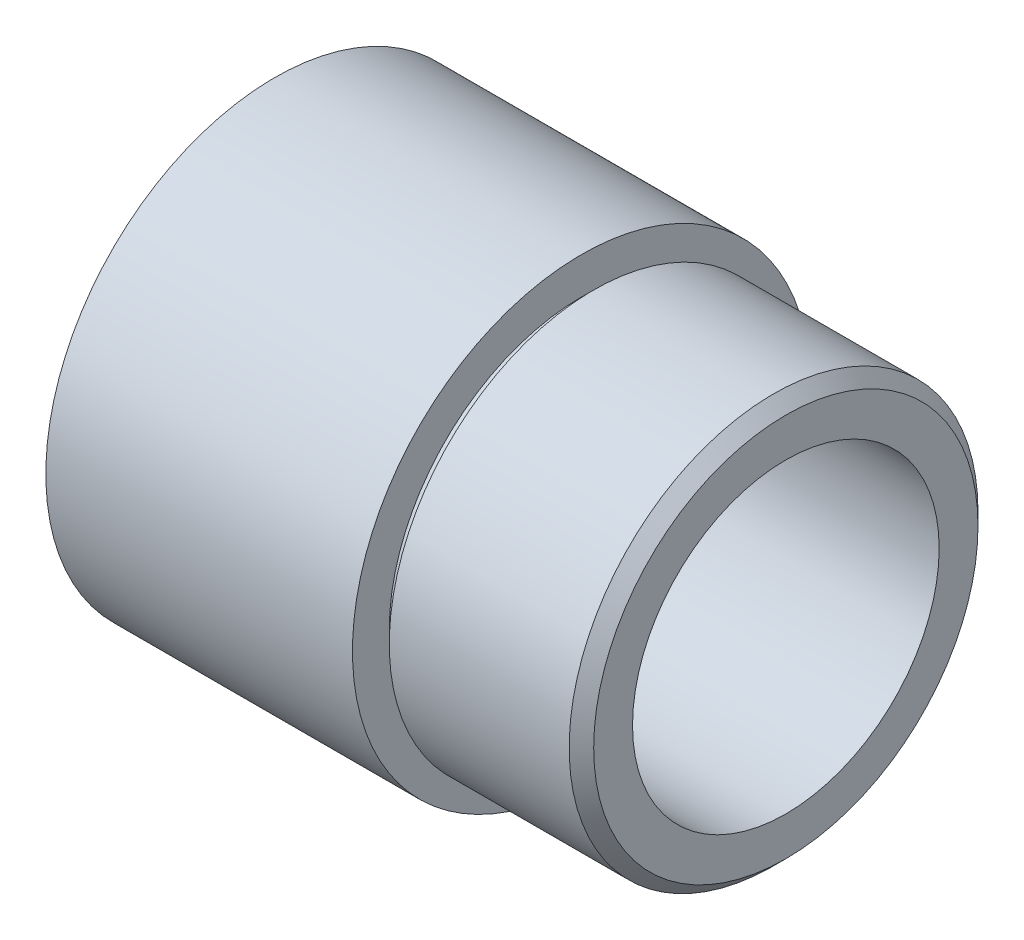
ISO-10303-21;
HEADER;
FILE_DESCRIPTION(('STEP AP214'),'2;1');
FILE_NAME('part.step','',(''),(''),'','','');
FILE_SCHEMA(('AUTOMOTIVE_DESIGN { 1 0 10303 214 1 1 1 1 }'));
ENDSEC;
DATA;
#1=APPLICATION_CONTEXT('core data for automotive mechanical design processes');
#2=APPLICATION_PROTOCOL_DEFINITION('international standard','automotive_design',2000,#1);
#3=PRODUCT_CONTEXT('',#1,'mechanical');
#4=PRODUCT('Part','Part','',(#3));
#5=PRODUCT_RELATED_PRODUCT_CATEGORY('part','',(#4));
#6=PRODUCT_DEFINITION_FORMATION('','',#4);
#7=PRODUCT_DEFINITION_CONTEXT('part definition',#1,'design');
#8=PRODUCT_DEFINITION('design','',#6,#7);
#9=PRODUCT_DEFINITION_SHAPE('','',#8);
#10=(LENGTH_UNIT() NAMED_UNIT(*) SI_UNIT(.MILLI.,.METRE.));
#11=(NAMED_UNIT(*) PLANE_ANGLE_UNIT() SI_UNIT($,.RADIAN.));
#12=(NAMED_UNIT(*) SI_UNIT($,.STERADIAN.) SOLID_ANGLE_UNIT());
#13=UNCERTAINTY_MEASURE_WITH_UNIT(LENGTH_MEASURE(1.E-05),#10,'distance_accuracy_value','');
#14=(GEOMETRIC_REPRESENTATION_CONTEXT(3) GLOBAL_UNCERTAINTY_ASSIGNED_CONTEXT((#13)) GLOBAL_UNIT_ASSIGNED_CONTEXT((#10,
#11,#12)) REPRESENTATION_CONTEXT('',''));
#15=CARTESIAN_POINT('',(0.,0.,0.));
#16=DIRECTION('',(0.,0.,1.));
#17=DIRECTION('',(1.,0.,0.));
#18=AXIS2_PLACEMENT_3D('',#15,#16,#17);
#19=CARTESIAN_POINT('',(291.972614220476,-9.52499999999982,0.));
#20=DIRECTION('',(1.,0.,0.));
#21=DIRECTION('',(0.,0.,-1.));
#22=AXIS2_PLACEMENT_3D('',#19,#20,#21);
#23=PLANE('',#22);
#24=CARTESIAN_POINT('',(291.972614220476,0.,0.));
#25=DIRECTION('',(1.,0.,0.));
#26=DIRECTION('',(0.,0.,-1.));
#27=AXIS2_PLACEMENT_3D('',#24,#25,#26);
#28=CIRCLE('',#27,14.2239999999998);
#29=CARTESIAN_POINT('',(291.972614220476,0.,-14.2239999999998));
#30=VERTEX_POINT('',#29);
#31=EDGE_CURVE('E10',#30,#30,#28,.T.);
#32=ORIENTED_EDGE('',*,*,#31,.F.);
#33=EDGE_LOOP('',(#32));
#34=FACE_BOUND('',#33,.T.);
#35=CARTESIAN_POINT('',(291.972614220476,0.,0.));
#36=DIRECTION('',(1.,0.,0.));
#37=DIRECTION('',(0.,0.,-1.));
#38=AXIS2_PLACEMENT_3D('',#35,#36,#37);
#39=CIRCLE('',#38,9.52499999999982);
#40=CARTESIAN_POINT('',(291.972614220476,0.,-9.52499999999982));
#41=VERTEX_POINT('',#40);
#42=EDGE_CURVE('E43',#41,#41,#39,.T.);
#43=ORIENTED_EDGE('',*,*,#42,.T.);
#44=EDGE_LOOP('',(#43));
#45=FACE_BOUND('',#44,.T.);
#46=ADVANCED_FACE('F29',(#34,#45),#23,.F.);
#47=CARTESIAN_POINT('',(0.,0.,0.));
#48=DIRECTION('',(1.,0.,0.));
#49=DIRECTION('',(0.,0.,-1.));
#50=AXIS2_PLACEMENT_3D('',#47,#48,#49);
#51=CYLINDRICAL_SURFACE('',#50,14.2239999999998);
#52=CARTESIAN_POINT('',(311.022614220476,0.,0.));
#53=DIRECTION('',(1.,0.,0.));
#54=DIRECTION('',(0.,0.,-1.));
#55=AXIS2_PLACEMENT_3D('',#52,#53,#54);
#56=CIRCLE('',#55,14.2239999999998);
#57=CARTESIAN_POINT('',(311.022614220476,0.,-14.2239999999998));
#58=VERTEX_POINT('',#57);
#59=EDGE_CURVE('E35',#58,#58,#56,.T.);
#60=ORIENTED_EDGE('',*,*,#59,.F.);
#61=EDGE_LOOP('',(#60));
#62=FACE_BOUND('',#61,.T.);
#63=ORIENTED_EDGE('',*,*,#31,.T.);
#64=EDGE_LOOP('',(#63));
#65=FACE_BOUND('',#64,.T.);
#66=ADVANCED_FACE('F82',(#62,#65),#51,.T.);
#67=CARTESIAN_POINT('',(311.022614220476,-14.2239999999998,0.));
#68=DIRECTION('',(-1.,0.,0.));
#69=DIRECTION('',(0.,0.,1.));
#70=AXIS2_PLACEMENT_3D('',#67,#68,#69);
#71=PLANE('',#70);
#72=ORIENTED_EDGE('',*,*,#59,.T.);
#73=EDGE_LOOP('',(#72));
#74=FACE_BOUND('',#73,.T.);
#75=CARTESIAN_POINT('',(311.022614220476,0.,0.));
#76=DIRECTION('',(1.,0.,0.));
#77=DIRECTION('',(0.,0.,-1.));
#78=AXIS2_PLACEMENT_3D('',#75,#76,#77);
#79=CIRCLE('',#78,11.9379999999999);
#80=CARTESIAN_POINT('',(311.022614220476,0.,-11.9379999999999));
#81=VERTEX_POINT('',#80);
#82=EDGE_CURVE('E57',#81,#81,#79,.T.);
#83=ORIENTED_EDGE('',*,*,#82,.F.);
#84=EDGE_LOOP('',(#83));
#85=FACE_BOUND('',#84,.T.);
#86=ADVANCED_FACE('F80',(#74,#85),#71,.F.);
#87=CARTESIAN_POINT('',(0.,0.,0.));
#88=DIRECTION('',(1.,0.,0.));
#89=DIRECTION('',(0.,0.,-1.));
#90=AXIS2_PLACEMENT_3D('',#87,#88,#89);
#91=CYLINDRICAL_SURFACE('',#90,12.6999999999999);
#92=CARTESIAN_POINT('',(311.784614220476,0.,0.));
#93=DIRECTION('',(1.,0.,0.));
#94=DIRECTION('',(0.,0.,-1.));
#95=AXIS2_PLACEMENT_3D('',#92,#93,#94);
#96=CIRCLE('',#95,12.6999999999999);
#97=CARTESIAN_POINT('',(311.784614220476,0.,-12.6999999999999));
#98=VERTEX_POINT('',#97);
#99=EDGE_CURVE('E60',#98,#98,#96,.T.);
#100=ORIENTED_EDGE('',*,*,#99,.T.);
#101=EDGE_LOOP('',(#100));
#102=FACE_BOUND('',#101,.T.);
#103=CARTESIAN_POINT('',(322.960614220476,0.,0.));
#104=DIRECTION('',(1.,0.,0.));
#105=DIRECTION('',(0.,0.,-1.));
#106=AXIS2_PLACEMENT_3D('',#103,#104,#105);
#107=CIRCLE('',#106,12.6999999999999);
#108=CARTESIAN_POINT('',(322.960614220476,0.,-12.6999999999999));
#109=VERTEX_POINT('',#108);
#110=EDGE_CURVE('E51',#109,#109,#107,.T.);
#111=ORIENTED_EDGE('',*,*,#110,.F.);
#112=EDGE_LOOP('',(#111));
#113=FACE_BOUND('',#112,.T.);
#114=ADVANCED_FACE('F64',(#102,#113),#91,.T.);
#115=CARTESIAN_POINT('',(323.722614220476,-12.6999999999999,0.));
#116=DIRECTION('',(-1.,0.,0.));
#117=DIRECTION('',(0.,0.,1.));
#118=AXIS2_PLACEMENT_3D('',#115,#116,#117);
#119=PLANE('',#118);
#120=CARTESIAN_POINT('',(323.722614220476,0.,0.));
#121=DIRECTION('',(1.,0.,0.));
#122=DIRECTION('',(0.,0.,-1.));
#123=AXIS2_PLACEMENT_3D('',#120,#121,#122);
#124=CIRCLE('',#123,11.9379999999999);
#125=CARTESIAN_POINT('',(323.722614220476,0.,-11.9379999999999));
#126=VERTEX_POINT('',#125);
#127=EDGE_CURVE('E48',#126,#126,#124,.T.);
#128=ORIENTED_EDGE('',*,*,#127,.T.);
#129=EDGE_LOOP('',(#128));
#130=FACE_BOUND('',#129,.T.);
#131=CARTESIAN_POINT('',(323.722614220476,0.,0.));
#132=DIRECTION('',(1.,0.,0.));
#133=DIRECTION('',(0.,0.,-1.));
#134=AXIS2_PLACEMENT_3D('',#131,#132,#133);
#135=CIRCLE('',#134,9.52499999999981);
#136=CARTESIAN_POINT('',(323.722614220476,0.,-9.52499999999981));
#137=VERTEX_POINT('',#136);
#138=EDGE_CURVE('E39',#137,#137,#135,.T.);
#139=ORIENTED_EDGE('',*,*,#138,.F.);
#140=EDGE_LOOP('',(#139));
#141=FACE_BOUND('',#140,.T.);
#142=ADVANCED_FACE('F88',(#130,#141),#119,.F.);
#143=CARTESIAN_POINT('',(0.,0.,0.));
#144=DIRECTION('',(1.,0.,0.));
#145=DIRECTION('',(0.,0.,-1.));
#146=AXIS2_PLACEMENT_3D('',#143,#144,#145);
#147=CYLINDRICAL_SURFACE('',#146,9.52499999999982);
#148=ORIENTED_EDGE('',*,*,#42,.F.);
#149=EDGE_LOOP('',(#148));
#150=FACE_BOUND('',#149,.T.);
#151=ORIENTED_EDGE('',*,*,#138,.T.);
#152=EDGE_LOOP('',(#151));
#153=FACE_BOUND('',#152,.T.);
#154=ADVANCED_FACE('F98',(#150,#153),#147,.F.);
#155=CARTESIAN_POINT('',(322.960614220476,0.,0.));
#156=DIRECTION('',(-1.,0.,0.));
#157=DIRECTION('',(0.,0.,1.));
#158=AXIS2_PLACEMENT_3D('',#155,#156,#157);
#159=CONICAL_SURFACE('',#158,12.6999999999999,0.78539816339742);
#160=ORIENTED_EDGE('',*,*,#127,.F.);
#161=EDGE_LOOP('',(#160));
#162=FACE_BOUND('',#161,.T.);
#163=ORIENTED_EDGE('',*,*,#110,.T.);
#164=EDGE_LOOP('',(#163));
#165=FACE_BOUND('',#164,.T.);
#166=ADVANCED_FACE('F71',(#162,#165),#159,.T.);
#167=CARTESIAN_POINT('',(311.784614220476,12.6999999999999,0.));
#168=DIRECTION('',(1.,0.,0.));
#169=DIRECTION('',(0.,0.,-1.));
#170=AXIS2_PLACEMENT_3D('',#167,#168,#169);
#171=PLANE('',#170);
#172=ORIENTED_EDGE('',*,*,#99,.F.);
#173=EDGE_LOOP('',(#172));
#174=FACE_BOUND('',#173,.T.);
#175=CARTESIAN_POINT('',(311.784614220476,0.,0.));
#176=DIRECTION('',(1.,0.,0.));
#177=DIRECTION('',(0.,0.,-1.));
#178=AXIS2_PLACEMENT_3D('',#175,#176,#177);
#179=CIRCLE('',#178,11.9379999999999);
#180=CARTESIAN_POINT('',(311.784614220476,0.,-11.9379999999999));
#181=VERTEX_POINT('',#180);
#182=EDGE_CURVE('E54',#181,#181,#179,.T.);
#183=ORIENTED_EDGE('',*,*,#182,.T.);
#184=EDGE_LOOP('',(#183));
#185=FACE_BOUND('',#184,.T.);
#186=ADVANCED_FACE('F67',(#174,#185),#171,.F.);
#187=CARTESIAN_POINT('',(0.,0.,0.));
#188=DIRECTION('',(1.,0.,0.));
#189=DIRECTION('',(0.,0.,-1.));
#190=AXIS2_PLACEMENT_3D('',#187,#188,#189);
#191=CYLINDRICAL_SURFACE('',#190,11.9379999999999);
#192=ORIENTED_EDGE('',*,*,#182,.F.);
#193=EDGE_LOOP('',(#192));
#194=FACE_BOUND('',#193,.T.);
#195=ORIENTED_EDGE('',*,*,#82,.T.);
#196=EDGE_LOOP('',(#195));
#197=FACE_BOUND('',#196,.T.);
#198=ADVANCED_FACE('F70',(#194,#197),#191,.T.);
#199=CLOSED_SHELL('',(#46,#66,#86,#114,#142,#154,#166,#186,#198));
#200=MANIFOLD_SOLID_BREP('B2',#199);
#201=ADVANCED_BREP_SHAPE_REPRESENTATION('',(#18,#200),#14);
#202=SHAPE_DEFINITION_REPRESENTATION(#9,#201);
ENDSEC;
END-ISO-10303-21;
